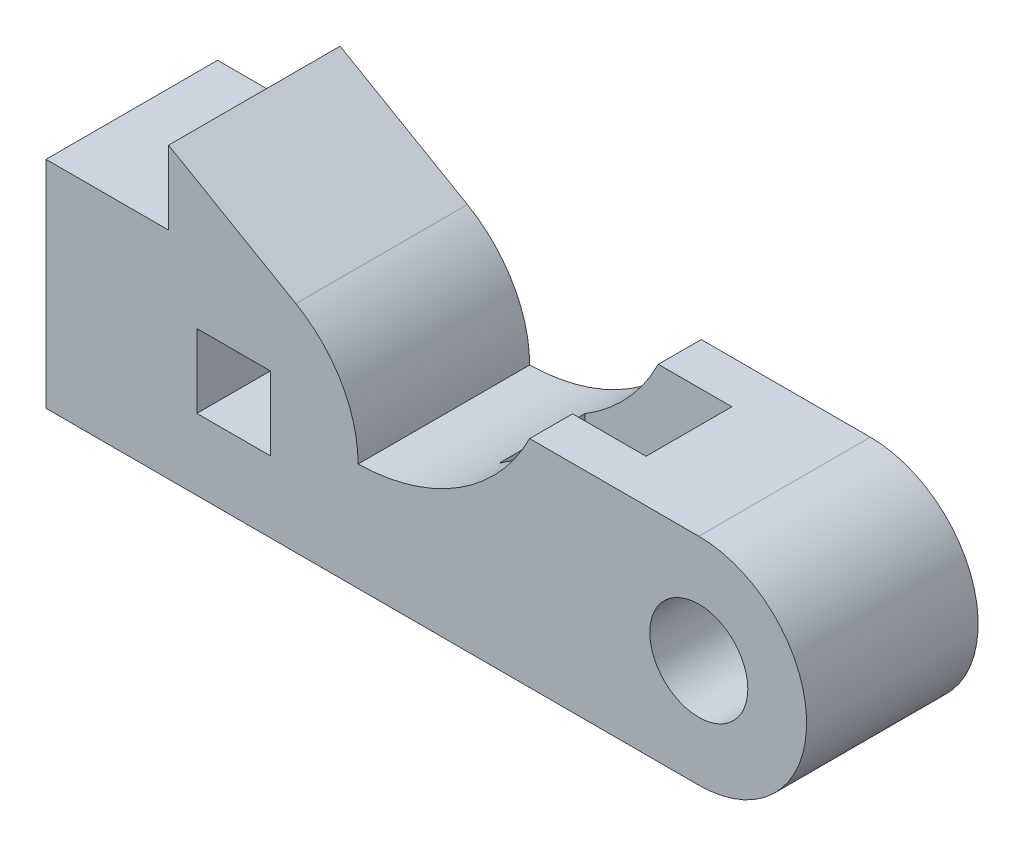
from build123d import *

# Parameters (mm, degrees)
SKETCH2_W               = 30
SKETCH2_H               = 30
BOSS_EXTRUDE1_DEPTH     = 35
SKETCH3_W               = 60
SKETCH3_H               = 35
CUT_EXTRUDE1_DEPTH      = 325.492516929
CUT_EXTRUDE2_DEPTH      = 334.879309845
CUT_EXTRUDE2_DEPTH_BACK = 334.879309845
SKETCH4_R               = 20


with BuildPart() as part:
    # Sketch2 → Boss-Extrude1 (new, symmetric)
    with BuildSketch(Plane.XY):
        with BuildLine():
            Line((0, 0), (0, 88))
            Line((0, 88), (50, 88))
            Line((50, 88), (50, 118))
            Line((50, 118), (101.961524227, 88))
            ThreePointArc((101.961524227, 88), (120.558112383, 69.403411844), (127.364936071, 44))
            ThreePointArc((127.364936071, 44), (168.489764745, 56.255954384), (197.364936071, 88))
            Line((197.364936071, 88), (266.364936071, 88))
            ThreePointArc((266.364936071, 88), (310.364936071, 44), (266.364936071, 0))
            Line((266.364936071, 0), (0, 0))
        make_face()
        with Locations((76.558112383, 44)):
            Rectangle(SKETCH2_W, SKETCH2_H, mode=Mode.SUBTRACT)
    extrude(amount=BOSS_EXTRUDE1_DEPTH, both=True)

    # Sketch3 → Cut-Extrude1 (cut, through all)
    with BuildSketch(Plane(origin=(0, 88, 0), x_dir=(1, 0, 0), z_dir=(0, 1, 0))):
        with Locations((197.364936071, 0)):
            Rectangle(SKETCH3_W, SKETCH3_H)
    extrude(amount=-CUT_EXTRUDE1_DEPTH, mode=Mode.SUBTRACT)

    # Sketch4 → Cut-Extrude2 (cut, two sides: drawn at the far end of the back side and taken through both)
    with BuildSketch(Plane.XY.offset(-CUT_EXTRUDE2_DEPTH_BACK)):
        with Locations((266.364936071, 44)):
            Circle(SKETCH4_R)
    extrude(amount=CUT_EXTRUDE2_DEPTH + CUT_EXTRUDE2_DEPTH_BACK, mode=Mode.SUBTRACT)


solid = part.part
